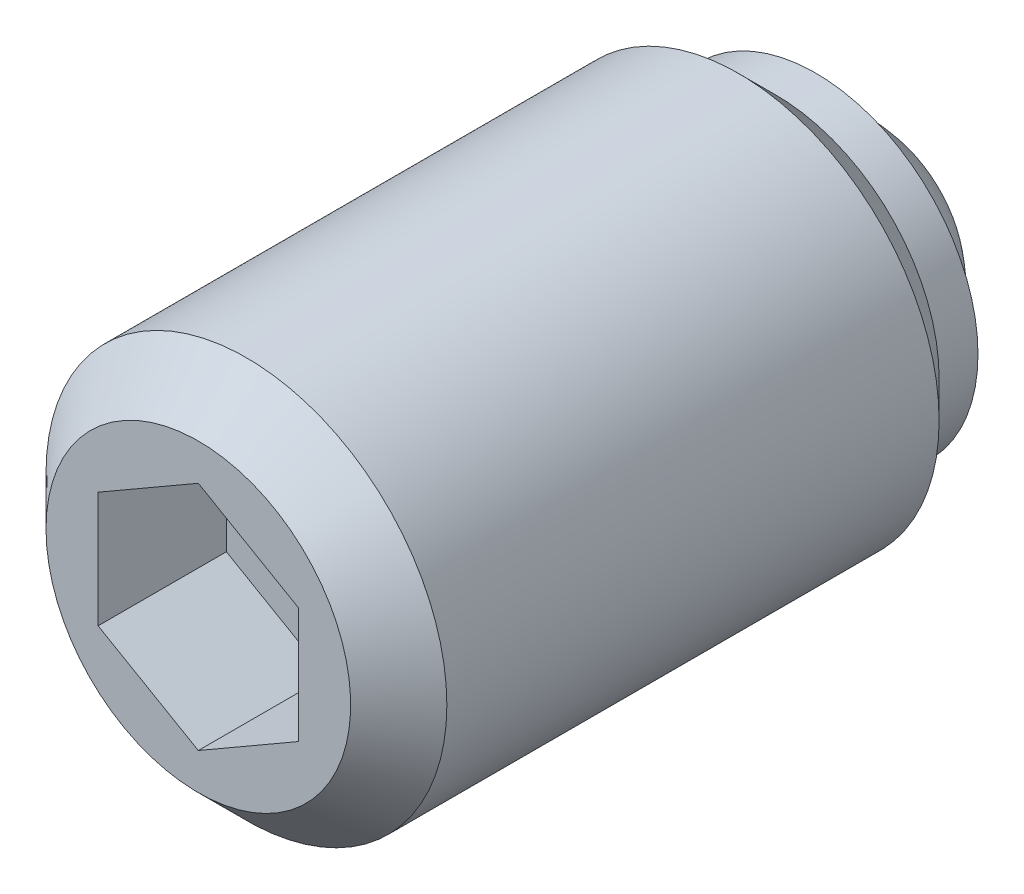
ISO-10303-21;
HEADER;
FILE_DESCRIPTION(('STEP AP214'),'2;1');
FILE_NAME('part.step','',(''),(''),'','','');
FILE_SCHEMA(('AUTOMOTIVE_DESIGN { 1 0 10303 214 1 1 1 1 }'));
ENDSEC;
DATA;
#1=APPLICATION_CONTEXT('core data for automotive mechanical design processes');
#2=APPLICATION_PROTOCOL_DEFINITION('international standard','automotive_design',2000,#1);
#3=PRODUCT_CONTEXT('',#1,'mechanical');
#4=PRODUCT('Part','Part','',(#3));
#5=PRODUCT_RELATED_PRODUCT_CATEGORY('part','',(#4));
#6=PRODUCT_DEFINITION_FORMATION('','',#4);
#7=PRODUCT_DEFINITION_CONTEXT('part definition',#1,'design');
#8=PRODUCT_DEFINITION('design','',#6,#7);
#9=PRODUCT_DEFINITION_SHAPE('','',#8);
#10=(LENGTH_UNIT() NAMED_UNIT(*) SI_UNIT(.MILLI.,.METRE.));
#11=(NAMED_UNIT(*) PLANE_ANGLE_UNIT() SI_UNIT($,.RADIAN.));
#12=(NAMED_UNIT(*) SI_UNIT($,.STERADIAN.) SOLID_ANGLE_UNIT());
#13=UNCERTAINTY_MEASURE_WITH_UNIT(LENGTH_MEASURE(1.E-05),#10,'distance_accuracy_value','');
#14=(GEOMETRIC_REPRESENTATION_CONTEXT(3) GLOBAL_UNCERTAINTY_ASSIGNED_CONTEXT((#13)) GLOBAL_UNIT_ASSIGNED_CONTEXT((#10,
#11,#12)) REPRESENTATION_CONTEXT('',''));
#15=CARTESIAN_POINT('',(0.,0.,0.));
#16=DIRECTION('',(0.,0.,1.));
#17=DIRECTION('',(1.,0.,0.));
#18=AXIS2_PLACEMENT_3D('',#15,#16,#17);
#19=CARTESIAN_POINT('',(0.,0.,14.5));
#20=DIRECTION('',(0.,0.,-1.));
#21=DIRECTION('',(-1.,0.,0.));
#22=AXIS2_PLACEMENT_3D('',#19,#20,#21);
#23=PLANE('',#22);
#24=DIRECTION('',(0.,1.,0.));
#25=VECTOR('',#24,1.);
#26=CARTESIAN_POINT('',(-2.5,-1.44337567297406,14.5));
#27=LINE('',#26,#25);
#28=CARTESIAN_POINT('',(-2.5,-1.44337567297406,14.5));
#29=VERTEX_POINT('',#28);
#30=CARTESIAN_POINT('',(-2.5,1.44337567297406,14.5));
#31=VERTEX_POINT('',#30);
#32=EDGE_CURVE('E80',#29,#31,#27,.T.);
#33=ORIENTED_EDGE('',*,*,#32,.F.);
#34=DIRECTION('',(0.866025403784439,-0.5,0.));
#35=VECTOR('',#34,1.);
#36=CARTESIAN_POINT('',(0.,-2.88675134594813,14.5));
#37=LINE('',#36,#35);
#38=CARTESIAN_POINT('',(0.,-2.88675134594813,14.5));
#39=VERTEX_POINT('',#38);
#40=EDGE_CURVE('E102',#39,#29,#37,.F.);
#41=ORIENTED_EDGE('',*,*,#40,.F.);
#42=DIRECTION('',(-0.866025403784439,-0.5,0.));
#43=VECTOR('',#42,1.);
#44=CARTESIAN_POINT('',(1.25,-2.1650635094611,14.5));
#45=LINE('',#44,#43);
#46=CARTESIAN_POINT('',(2.5,-1.44337567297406,14.5));
#47=VERTEX_POINT('',#46);
#48=EDGE_CURVE('E81',#47,#39,#45,.T.);
#49=ORIENTED_EDGE('',*,*,#48,.F.);
#50=DIRECTION('',(0.,1.,0.));
#51=VECTOR('',#50,1.);
#52=CARTESIAN_POINT('',(2.5,0.,14.5));
#53=LINE('',#52,#51);
#54=CARTESIAN_POINT('',(2.5,1.44337567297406,14.5));
#55=VERTEX_POINT('',#54);
#56=EDGE_CURVE('E64',#55,#47,#53,.F.);
#57=ORIENTED_EDGE('',*,*,#56,.F.);
#58=DIRECTION('',(0.866025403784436,-0.5,0.));
#59=VECTOR('',#58,1.);
#60=CARTESIAN_POINT('',(1.25,2.1650635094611,14.5));
#61=LINE('',#60,#59);
#62=CARTESIAN_POINT('',(0.,2.88675134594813,14.5));
#63=VERTEX_POINT('',#62);
#64=EDGE_CURVE('E67',#63,#55,#61,.T.);
#65=ORIENTED_EDGE('',*,*,#64,.F.);
#66=DIRECTION('',(0.866025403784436,0.5,0.));
#67=VECTOR('',#66,1.);
#68=CARTESIAN_POINT('',(-2.5,1.44337567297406,14.5));
#69=LINE('',#68,#67);
#70=EDGE_CURVE('E69',#31,#63,#69,.T.);
#71=ORIENTED_EDGE('',*,*,#70,.F.);
#72=EDGE_LOOP('',(#33,#41,#49,#57,#65,#71));
#73=FACE_BOUND('',#72,.T.);
#74=ADVANCED_FACE('F14',(#73),#23,.F.);
#75=CARTESIAN_POINT('',(-2.5,-1.44337567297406,14.5));
#76=DIRECTION('',(1.,0.,0.));
#77=DIRECTION('',(0.,0.,-1.));
#78=AXIS2_PLACEMENT_3D('',#75,#76,#77);
#79=PLANE('',#78);
#80=ORIENTED_EDGE('',*,*,#32,.T.);
#81=DIRECTION('',(0.,0.,-1.));
#82=VECTOR('',#81,1.);
#83=CARTESIAN_POINT('',(-2.5,1.44337567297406,14.5));
#84=LINE('',#83,#82);
#85=CARTESIAN_POINT('',(-2.5,1.44337567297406,17.7));
#86=VERTEX_POINT('',#85);
#87=EDGE_CURVE('E79',#86,#31,#84,.T.);
#88=ORIENTED_EDGE('',*,*,#87,.F.);
#89=DIRECTION('',(0.,1.,0.));
#90=VECTOR('',#89,1.);
#91=CARTESIAN_POINT('',(-2.5,0.,17.7));
#92=LINE('',#91,#90);
#93=CARTESIAN_POINT('',(-2.5,-1.44337567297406,17.7));
#94=VERTEX_POINT('',#93);
#95=EDGE_CURVE('E84',#86,#94,#92,.F.);
#96=ORIENTED_EDGE('',*,*,#95,.T.);
#97=DIRECTION('',(0.,0.,-1.));
#98=VECTOR('',#97,1.);
#99=CARTESIAN_POINT('',(-2.5,-1.44337567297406,14.5));
#100=LINE('',#99,#98);
#101=EDGE_CURVE('E96',#29,#94,#100,.F.);
#102=ORIENTED_EDGE('',*,*,#101,.F.);
#103=EDGE_LOOP('',(#80,#88,#96,#102));
#104=FACE_BOUND('',#103,.T.);
#105=ADVANCED_FACE('F169',(#104),#79,.T.);
#106=CARTESIAN_POINT('',(0.,-2.88675134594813,14.5));
#107=DIRECTION('',(0.5,0.866025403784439,0.));
#108=DIRECTION('',(0.866025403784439,-0.5,0.));
#109=AXIS2_PLACEMENT_3D('',#106,#107,#108);
#110=PLANE('',#109);
#111=ORIENTED_EDGE('',*,*,#40,.T.);
#112=ORIENTED_EDGE('',*,*,#101,.T.);
#113=DIRECTION('',(0.866025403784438,-0.5,0.));
#114=VECTOR('',#113,1.);
#115=CARTESIAN_POINT('',(-2.5,-1.44337567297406,17.7));
#116=LINE('',#115,#114);
#117=CARTESIAN_POINT('',(0.,-2.88675134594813,17.7));
#118=VERTEX_POINT('',#117);
#119=EDGE_CURVE('E85',#94,#118,#116,.T.);
#120=ORIENTED_EDGE('',*,*,#119,.T.);
#121=DIRECTION('',(0.,0.,-1.));
#122=VECTOR('',#121,1.);
#123=CARTESIAN_POINT('',(0.,-2.88675134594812,14.5));
#124=LINE('',#123,#122);
#125=EDGE_CURVE('E94',#39,#118,#124,.F.);
#126=ORIENTED_EDGE('',*,*,#125,.F.);
#127=EDGE_LOOP('',(#111,#112,#120,#126));
#128=FACE_BOUND('',#127,.T.);
#129=ADVANCED_FACE('F173',(#128),#110,.T.);
#130=CARTESIAN_POINT('',(2.5,-1.44337567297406,14.5));
#131=DIRECTION('',(-0.5,0.866025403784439,0.));
#132=DIRECTION('',(0.866025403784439,0.5,0.));
#133=AXIS2_PLACEMENT_3D('',#130,#131,#132);
#134=PLANE('',#133);
#135=ORIENTED_EDGE('',*,*,#48,.T.);
#136=ORIENTED_EDGE('',*,*,#125,.T.);
#137=DIRECTION('',(0.866025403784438,0.5,0.));
#138=VECTOR('',#137,1.);
#139=CARTESIAN_POINT('',(0.,-2.88675134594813,17.7));
#140=LINE('',#139,#138);
#141=CARTESIAN_POINT('',(2.5,-1.44337567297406,17.7));
#142=VERTEX_POINT('',#141);
#143=EDGE_CURVE('E108',#118,#142,#140,.T.);
#144=ORIENTED_EDGE('',*,*,#143,.T.);
#145=DIRECTION('',(0.,0.,1.));
#146=VECTOR('',#145,1.);
#147=CARTESIAN_POINT('',(2.5,-1.44337567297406,14.5));
#148=LINE('',#147,#146);
#149=EDGE_CURVE('E91',#47,#142,#148,.T.);
#150=ORIENTED_EDGE('',*,*,#149,.F.);
#151=EDGE_LOOP('',(#135,#136,#144,#150));
#152=FACE_BOUND('',#151,.T.);
#153=ADVANCED_FACE('F178',(#152),#134,.T.);
#154=CARTESIAN_POINT('',(2.5,1.44337567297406,14.5));
#155=DIRECTION('',(-1.,0.,0.));
#156=DIRECTION('',(0.,0.,1.));
#157=AXIS2_PLACEMENT_3D('',#154,#155,#156);
#158=PLANE('',#157);
#159=ORIENTED_EDGE('',*,*,#56,.T.);
#160=ORIENTED_EDGE('',*,*,#149,.T.);
#161=DIRECTION('',(0.,1.,0.));
#162=VECTOR('',#161,1.);
#163=CARTESIAN_POINT('',(2.5,0.,17.7));
#164=LINE('',#163,#162);
#165=CARTESIAN_POINT('',(2.5,1.44337567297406,17.7));
#166=VERTEX_POINT('',#165);
#167=EDGE_CURVE('E110',#142,#166,#164,.T.);
#168=ORIENTED_EDGE('',*,*,#167,.T.);
#169=DIRECTION('',(0.,0.,-1.));
#170=VECTOR('',#169,1.);
#171=CARTESIAN_POINT('',(2.5,1.44337567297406,14.5));
#172=LINE('',#171,#170);
#173=EDGE_CURVE('E87',#55,#166,#172,.F.);
#174=ORIENTED_EDGE('',*,*,#173,.F.);
#175=EDGE_LOOP('',(#159,#160,#168,#174));
#176=FACE_BOUND('',#175,.T.);
#177=ADVANCED_FACE('F184',(#176),#158,.T.);
#178=CARTESIAN_POINT('',(0.,2.88675134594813,14.5));
#179=DIRECTION('',(-0.5,-0.866025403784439,0.));
#180=DIRECTION('',(-0.866025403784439,0.5,0.));
#181=AXIS2_PLACEMENT_3D('',#178,#179,#180);
#182=PLANE('',#181);
#183=ORIENTED_EDGE('',*,*,#64,.T.);
#184=ORIENTED_EDGE('',*,*,#173,.T.);
#185=DIRECTION('',(-0.866025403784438,0.5,0.));
#186=VECTOR('',#185,1.);
#187=CARTESIAN_POINT('',(2.5,1.44337567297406,17.7));
#188=LINE('',#187,#186);
#189=CARTESIAN_POINT('',(0.,2.88675134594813,17.7));
#190=VERTEX_POINT('',#189);
#191=EDGE_CURVE('E31',#166,#190,#188,.T.);
#192=ORIENTED_EDGE('',*,*,#191,.T.);
#193=DIRECTION('',(0.,0.,-1.));
#194=VECTOR('',#193,1.);
#195=CARTESIAN_POINT('',(0.,2.88675134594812,14.5));
#196=LINE('',#195,#194);
#197=EDGE_CURVE('E77',#63,#190,#196,.F.);
#198=ORIENTED_EDGE('',*,*,#197,.F.);
#199=EDGE_LOOP('',(#183,#184,#192,#198));
#200=FACE_BOUND('',#199,.T.);
#201=ADVANCED_FACE('F83',(#200),#182,.T.);
#202=CARTESIAN_POINT('',(-2.5,1.44337567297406,14.5));
#203=DIRECTION('',(0.5,-0.866025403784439,0.));
#204=DIRECTION('',(-0.866025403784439,-0.5,0.));
#205=AXIS2_PLACEMENT_3D('',#202,#203,#204);
#206=PLANE('',#205);
#207=ORIENTED_EDGE('',*,*,#70,.T.);
#208=ORIENTED_EDGE('',*,*,#197,.T.);
#209=DIRECTION('',(-0.866025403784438,-0.5,0.));
#210=VECTOR('',#209,1.);
#211=CARTESIAN_POINT('',(0.,2.88675134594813,17.7));
#212=LINE('',#211,#210);
#213=EDGE_CURVE('E113',#190,#86,#212,.T.);
#214=ORIENTED_EDGE('',*,*,#213,.T.);
#215=ORIENTED_EDGE('',*,*,#87,.T.);
#216=EDGE_LOOP('',(#207,#208,#214,#215));
#217=FACE_BOUND('',#216,.T.);
#218=ADVANCED_FACE('F75',(#217),#206,.T.);
#219=CARTESIAN_POINT('',(0.,0.,17.7));
#220=DIRECTION('',(0.,0.,-1.));
#221=DIRECTION('',(-1.,0.,0.));
#222=AXIS2_PLACEMENT_3D('',#219,#220,#221);
#223=PLANE('',#222);
#224=ORIENTED_EDGE('',*,*,#191,.F.);
#225=ORIENTED_EDGE('',*,*,#167,.F.);
#226=ORIENTED_EDGE('',*,*,#143,.F.);
#227=ORIENTED_EDGE('',*,*,#119,.F.);
#228=ORIENTED_EDGE('',*,*,#95,.F.);
#229=ORIENTED_EDGE('',*,*,#213,.F.);
#230=EDGE_LOOP('',(#224,#225,#226,#227,#228,#229));
#231=FACE_BOUND('',#230,.T.);
#232=CARTESIAN_POINT('',(0.,0.,17.7));
#233=DIRECTION('',(0.,0.,-1.));
#234=DIRECTION('',(-1.,0.,0.));
#235=AXIS2_PLACEMENT_3D('',#232,#233,#234);
#236=CIRCLE('',#235,3.8000000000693);
#237=CARTESIAN_POINT('',(-3.8000000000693,0.,17.7));
#238=VERTEX_POINT('',#237);
#239=EDGE_CURVE('E17',#238,#238,#236,.T.);
#240=ORIENTED_EDGE('',*,*,#239,.F.);
#241=EDGE_LOOP('',(#240));
#242=FACE_BOUND('',#241,.T.);
#243=ADVANCED_FACE('F193',(#231,#242),#223,.F.);
#244=CARTESIAN_POINT('',(0.,0.,16.5000000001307));
#245=DIRECTION('',(0.,0.,-1.));
#246=DIRECTION('',(-1.,0.,0.));
#247=AXIS2_PLACEMENT_3D('',#244,#245,#246);
#248=CONICAL_SURFACE('',#247,4.99999999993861,0.785398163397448);
#249=ORIENTED_EDGE('',*,*,#239,.T.);
#250=EDGE_LOOP('',(#249));
#251=FACE_BOUND('',#250,.T.);
#252=CARTESIAN_POINT('',(0.,0.,16.5));
#253=DIRECTION('',(0.,0.,1.));
#254=DIRECTION('',(1.,0.,0.));
#255=AXIS2_PLACEMENT_3D('',#252,#253,#254);
#256=CIRCLE('',#255,5.);
#257=CARTESIAN_POINT('',(5.,0.,16.5));
#258=VERTEX_POINT('',#257);
#259=EDGE_CURVE('E9',#258,#258,#256,.F.);
#260=ORIENTED_EDGE('',*,*,#259,.F.);
#261=EDGE_LOOP('',(#260));
#262=FACE_BOUND('',#261,.T.);
#263=ADVANCED_FACE('F165',(#251,#262),#248,.T.);
#264=CARTESIAN_POINT('',(0.,0.,6.3));
#265=DIRECTION('',(0.,0.,1.));
#266=DIRECTION('',(1.,0.,0.));
#267=AXIS2_PLACEMENT_3D('',#264,#265,#266);
#268=CYLINDRICAL_SURFACE('',#267,5.);
#269=ORIENTED_EDGE('',*,*,#259,.T.);
#270=EDGE_LOOP('',(#269));
#271=FACE_BOUND('',#270,.T.);
#272=CARTESIAN_POINT('',(0.,0.,4.22));
#273=DIRECTION('',(0.,0.,1.));
#274=DIRECTION('',(1.,0.,0.));
#275=AXIS2_PLACEMENT_3D('',#272,#273,#274);
#276=CIRCLE('',#275,5.);
#277=CARTESIAN_POINT('',(5.,0.,4.22));
#278=VERTEX_POINT('',#277);
#279=EDGE_CURVE('E128',#278,#278,#276,.T.);
#280=ORIENTED_EDGE('',*,*,#279,.T.);
#281=EDGE_LOOP('',(#280));
#282=FACE_BOUND('',#281,.T.);
#283=ADVANCED_FACE('F132',(#271,#282),#268,.T.);
#284=CARTESIAN_POINT('',(0.,0.,3.5));
#285=DIRECTION('',(0.,0.,1.));
#286=DIRECTION('',(0.,1.,0.));
#287=AXIS2_PLACEMENT_3D('',#284,#285,#286);
#288=SPHERICAL_SURFACE('',#287,3.5);
#289=CARTESIAN_POINT('',(0.,0.,2.3));
#290=DIRECTION('',(0.,0.,1.));
#291=DIRECTION('',(1.,0.,0.));
#292=AXIS2_PLACEMENT_3D('',#289,#290,#291);
#293=CIRCLE('',#292,3.28785644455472);
#294=CARTESIAN_POINT('',(3.28785644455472,0.,2.3));
#295=VERTEX_POINT('',#294);
#296=EDGE_CURVE('E71',#295,#295,#293,.T.);
#297=ORIENTED_EDGE('',*,*,#296,.F.);
#298=EDGE_LOOP('',(#297));
#299=FACE_BOUND('',#298,.T.);
#300=ADVANCED_FACE('F155',(#299),#288,.T.);
#301=CARTESIAN_POINT('',(0.,3.28785644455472,2.3));
#302=DIRECTION('',(0.,0.,1.));
#303=DIRECTION('',(1.,0.,0.));
#304=AXIS2_PLACEMENT_3D('',#301,#302,#303);
#305=PLANE('',#304);
#306=CARTESIAN_POINT('',(0.,0.,2.3));
#307=DIRECTION('',(0.,0.,1.));
#308=DIRECTION('',(1.,0.,0.));
#309=AXIS2_PLACEMENT_3D('',#306,#307,#308);
#310=CIRCLE('',#309,4.05000000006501);
#311=CARTESIAN_POINT('',(4.05000000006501,0.,2.3));
#312=VERTEX_POINT('',#311);
#313=EDGE_CURVE('E119',#312,#312,#310,.T.);
#314=ORIENTED_EDGE('',*,*,#313,.F.);
#315=EDGE_LOOP('',(#314));
#316=FACE_BOUND('',#315,.T.);
#317=ORIENTED_EDGE('',*,*,#296,.T.);
#318=EDGE_LOOP('',(#317));
#319=FACE_BOUND('',#318,.T.);
#320=ADVANCED_FACE('F149',(#316,#319),#305,.F.);
#321=CARTESIAN_POINT('',(0.,0.,21.0345981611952));
#322=DIRECTION('',(0.,0.,1.));
#323=DIRECTION('',(1.,0.,0.));
#324=AXIS2_PLACEMENT_3D('',#321,#322,#323);
#325=CYLINDRICAL_SURFACE('',#324,4.05000000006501);
#326=CARTESIAN_POINT('',(0.,0.,3.30000000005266));
#327=DIRECTION('',(0.,0.,1.));
#328=DIRECTION('',(1.,0.,0.));
#329=AXIS2_PLACEMENT_3D('',#326,#327,#328);
#330=CIRCLE('',#329,4.05000000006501);
#331=CARTESIAN_POINT('',(4.05000000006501,0.,3.30000000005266));
#332=VERTEX_POINT('',#331);
#333=EDGE_CURVE('E122',#332,#332,#330,.T.);
#334=ORIENTED_EDGE('',*,*,#333,.F.);
#335=EDGE_LOOP('',(#334));
#336=FACE_BOUND('',#335,.T.);
#337=ORIENTED_EDGE('',*,*,#313,.T.);
#338=EDGE_LOOP('',(#337));
#339=FACE_BOUND('',#338,.T.);
#340=ADVANCED_FACE('F143',(#336,#339),#325,.T.);
#341=CARTESIAN_POINT('',(0.,4.05000000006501,3.30000000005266));
#342=DIRECTION('',(0.,0.,1.));
#343=DIRECTION('',(1.,0.,0.));
#344=AXIS2_PLACEMENT_3D('',#341,#342,#343);
#345=PLANE('',#344);
#346=CARTESIAN_POINT('',(0.,0.,3.30000000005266));
#347=DIRECTION('',(0.,0.,1.));
#348=DIRECTION('',(1.,0.,0.));
#349=AXIS2_PLACEMENT_3D('',#346,#347,#348);
#350=CIRCLE('',#349,4.08000000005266);
#351=CARTESIAN_POINT('',(4.08000000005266,0.,3.30000000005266));
#352=VERTEX_POINT('',#351);
#353=EDGE_CURVE('E125',#352,#352,#350,.T.);
#354=ORIENTED_EDGE('',*,*,#353,.F.);
#355=EDGE_LOOP('',(#354));
#356=FACE_BOUND('',#355,.T.);
#357=ORIENTED_EDGE('',*,*,#333,.T.);
#358=EDGE_LOOP('',(#357));
#359=FACE_BOUND('',#358,.T.);
#360=ADVANCED_FACE('F137',(#356,#359),#345,.F.);
#361=CARTESIAN_POINT('',(0.,0.,3.30000000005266));
#362=DIRECTION('',(0.,0.,1.));
#363=DIRECTION('',(1.,0.,0.));
#364=AXIS2_PLACEMENT_3D('',#361,#362,#363);
#365=CONICAL_SURFACE('',#364,4.08000000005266,0.785398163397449);
#366=ORIENTED_EDGE('',*,*,#279,.F.);
#367=EDGE_LOOP('',(#366));
#368=FACE_BOUND('',#367,.T.);
#369=ORIENTED_EDGE('',*,*,#353,.T.);
#370=EDGE_LOOP('',(#369));
#371=FACE_BOUND('',#370,.T.);
#372=ADVANCED_FACE('F134',(#368,#371),#365,.T.);
#373=CLOSED_SHELL('',(#74,#105,#129,#153,#177,#201,#218,#243,#263,#283,#300,#320,#340,#360,#372));
#374=MANIFOLD_SOLID_BREP('B1',#373);
#375=ADVANCED_BREP_SHAPE_REPRESENTATION('',(#18,#374),#14);
#376=SHAPE_DEFINITION_REPRESENTATION(#9,#375);
ENDSEC;
END-ISO-10303-21;
